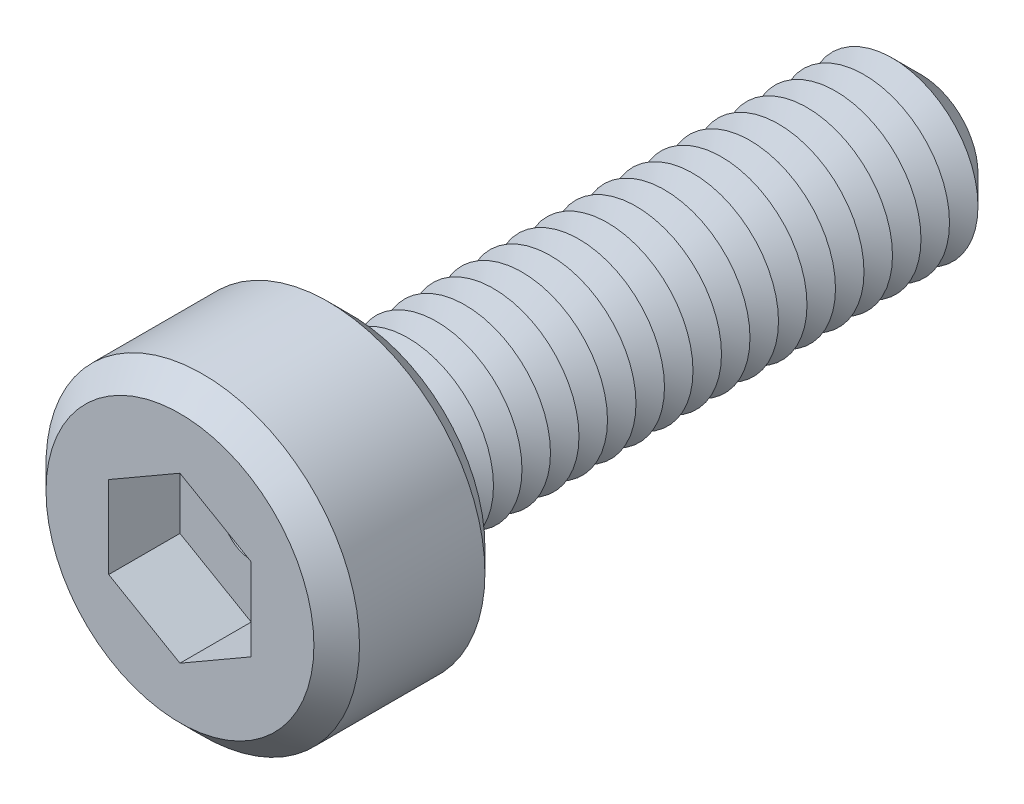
ISO-10303-21;
HEADER;
FILE_DESCRIPTION(('STEP AP214'),'2;1');
FILE_NAME('part.step','',(''),(''),'','','');
FILE_SCHEMA(('AUTOMOTIVE_DESIGN { 1 0 10303 214 1 1 1 1 }'));
ENDSEC;
DATA;
#1=APPLICATION_CONTEXT('core data for automotive mechanical design processes');
#2=APPLICATION_PROTOCOL_DEFINITION('international standard','automotive_design',2000,#1);
#3=PRODUCT_CONTEXT('',#1,'mechanical');
#4=PRODUCT('Part','Part','',(#3));
#5=PRODUCT_RELATED_PRODUCT_CATEGORY('part','',(#4));
#6=PRODUCT_DEFINITION_FORMATION('','',#4);
#7=PRODUCT_DEFINITION_CONTEXT('part definition',#1,'design');
#8=PRODUCT_DEFINITION('design','',#6,#7);
#9=PRODUCT_DEFINITION_SHAPE('','',#8);
#10=(LENGTH_UNIT() NAMED_UNIT(*) SI_UNIT(.MILLI.,.METRE.));
#11=(NAMED_UNIT(*) PLANE_ANGLE_UNIT() SI_UNIT($,.RADIAN.));
#12=(NAMED_UNIT(*) SI_UNIT($,.STERADIAN.) SOLID_ANGLE_UNIT());
#13=UNCERTAINTY_MEASURE_WITH_UNIT(LENGTH_MEASURE(1.E-05),#10,'distance_accuracy_value','');
#14=(GEOMETRIC_REPRESENTATION_CONTEXT(3) GLOBAL_UNCERTAINTY_ASSIGNED_CONTEXT((#13)) GLOBAL_UNIT_ASSIGNED_CONTEXT((#10,
#11,#12)) REPRESENTATION_CONTEXT('',''));
#15=CARTESIAN_POINT('',(0.,0.,0.));
#16=DIRECTION('',(0.,0.,1.));
#17=DIRECTION('',(1.,0.,0.));
#18=AXIS2_PLACEMENT_3D('',#15,#16,#17);
#19=CARTESIAN_POINT('',(0.,0.,3.));
#20=DIRECTION('',(0.,0.,-1.));
#21=DIRECTION('',(-1.,0.,0.));
#22=AXIS2_PLACEMENT_3D('',#19,#20,#21);
#23=CYLINDRICAL_SURFACE('',#22,2.75);
#24=CARTESIAN_POINT('',(0.,0.,0.4));
#25=DIRECTION('',(0.,0.,1.));
#26=DIRECTION('',(1.,0.,0.));
#27=AXIS2_PLACEMENT_3D('',#24,#25,#26);
#28=CIRCLE('',#27,2.75);
#29=CARTESIAN_POINT('',(2.75,0.,0.4));
#30=VERTEX_POINT('',#29);
#31=EDGE_CURVE('E328',#30,#30,#28,.T.);
#32=ORIENTED_EDGE('',*,*,#31,.T.);
#33=EDGE_LOOP('',(#32));
#34=FACE_BOUND('',#33,.T.);
#35=CARTESIAN_POINT('',(0.,0.,2.6));
#36=DIRECTION('',(0.,0.,1.));
#37=DIRECTION('',(1.,0.,0.));
#38=AXIS2_PLACEMENT_3D('',#35,#36,#37);
#39=CIRCLE('',#38,2.75);
#40=CARTESIAN_POINT('',(2.75,0.,2.6));
#41=VERTEX_POINT('',#40);
#42=EDGE_CURVE('E325',#41,#41,#39,.F.);
#43=ORIENTED_EDGE('',*,*,#42,.T.);
#44=EDGE_LOOP('',(#43));
#45=FACE_BOUND('',#44,.T.);
#46=ADVANCED_FACE('F39',(#34,#45),#23,.T.);
#47=CARTESIAN_POINT('',(0.,0.,3.));
#48=DIRECTION('',(0.,0.,1.));
#49=DIRECTION('',(1.,0.,0.));
#50=AXIS2_PLACEMENT_3D('',#47,#48,#49);
#51=PLANE('',#50);
#52=CARTESIAN_POINT('',(0.,0.,3.));
#53=DIRECTION('',(0.,0.,1.));
#54=DIRECTION('',(1.,0.,0.));
#55=AXIS2_PLACEMENT_3D('',#52,#53,#54);
#56=CIRCLE('',#55,2.35);
#57=CARTESIAN_POINT('',(2.35,0.,3.));
#58=VERTEX_POINT('',#57);
#59=EDGE_CURVE('E11',#58,#58,#56,.T.);
#60=ORIENTED_EDGE('',*,*,#59,.T.);
#61=EDGE_LOOP('',(#60));
#62=FACE_BOUND('',#61,.T.);
#63=DIRECTION('',(-0.866025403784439,0.5,0.));
#64=VECTOR('',#63,1.);
#65=CARTESIAN_POINT('',(1.25,0.721687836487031,3.));
#66=LINE('',#65,#64);
#67=CARTESIAN_POINT('',(1.25,0.721687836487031,3.));
#68=VERTEX_POINT('',#67);
#69=CARTESIAN_POINT('',(0.,1.44337567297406,3.));
#70=VERTEX_POINT('',#69);
#71=EDGE_CURVE('E55',#68,#70,#66,.T.);
#72=ORIENTED_EDGE('',*,*,#71,.F.);
#73=DIRECTION('',(0.,1.,0.));
#74=VECTOR('',#73,1.);
#75=CARTESIAN_POINT('',(1.25,-0.721687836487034,3.));
#76=LINE('',#75,#74);
#77=CARTESIAN_POINT('',(1.25,-0.721687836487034,3.));
#78=VERTEX_POINT('',#77);
#79=EDGE_CURVE('E151',#78,#68,#76,.T.);
#80=ORIENTED_EDGE('',*,*,#79,.F.);
#81=DIRECTION('',(0.866025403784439,0.5,0.));
#82=VECTOR('',#81,1.);
#83=CARTESIAN_POINT('',(0.,-1.44337567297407,3.));
#84=LINE('',#83,#82);
#85=CARTESIAN_POINT('',(0.,-1.44337567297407,3.));
#86=VERTEX_POINT('',#85);
#87=EDGE_CURVE('E148',#86,#78,#84,.T.);
#88=ORIENTED_EDGE('',*,*,#87,.F.);
#89=DIRECTION('',(0.866025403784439,-0.5,0.));
#90=VECTOR('',#89,1.);
#91=CARTESIAN_POINT('',(-1.25,-0.721687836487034,3.));
#92=LINE('',#91,#90);
#93=CARTESIAN_POINT('',(-1.25,-0.721687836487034,3.));
#94=VERTEX_POINT('',#93);
#95=EDGE_CURVE('E103',#94,#86,#92,.T.);
#96=ORIENTED_EDGE('',*,*,#95,.F.);
#97=DIRECTION('',(0.,-1.,0.));
#98=VECTOR('',#97,1.);
#99=CARTESIAN_POINT('',(-1.25,0.721687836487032,3.));
#100=LINE('',#99,#98);
#101=CARTESIAN_POINT('',(-1.25,0.721687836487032,3.));
#102=VERTEX_POINT('',#101);
#103=EDGE_CURVE('E142',#102,#94,#100,.T.);
#104=ORIENTED_EDGE('',*,*,#103,.F.);
#105=DIRECTION('',(-0.866025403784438,-0.5,0.));
#106=VECTOR('',#105,1.);
#107=CARTESIAN_POINT('',(0.,1.44337567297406,3.));
#108=LINE('',#107,#106);
#109=EDGE_CURVE('E137',#70,#102,#108,.T.);
#110=ORIENTED_EDGE('',*,*,#109,.F.);
#111=EDGE_LOOP('',(#72,#80,#88,#96,#104,#110));
#112=FACE_BOUND('',#111,.T.);
#113=ADVANCED_FACE('F346',(#62,#112),#51,.T.);
#114=CARTESIAN_POINT('',(0.,0.,0.));
#115=DIRECTION('',(0.,0.,1.));
#116=DIRECTION('',(1.,0.,0.));
#117=AXIS2_PLACEMENT_3D('',#114,#115,#116);
#118=PLANE('',#117);
#119=CARTESIAN_POINT('',(0.,0.,0.));
#120=DIRECTION('',(0.,0.,1.));
#121=DIRECTION('',(1.,0.,0.));
#122=AXIS2_PLACEMENT_3D('',#119,#120,#121);
#123=CIRCLE('',#122,2.35);
#124=CARTESIAN_POINT('',(2.35,0.,0.));
#125=VERTEX_POINT('',#124);
#126=EDGE_CURVE('E48',#125,#125,#123,.F.);
#127=ORIENTED_EDGE('',*,*,#126,.T.);
#128=EDGE_LOOP('',(#127));
#129=FACE_BOUND('',#128,.T.);
#130=CARTESIAN_POINT('',(0.,0.,0.));
#131=DIRECTION('',(0.,0.,1.));
#132=DIRECTION('',(1.,0.,0.));
#133=AXIS2_PLACEMENT_3D('',#130,#131,#132);
#134=CIRCLE('',#133,1.5);
#135=CARTESIAN_POINT('',(1.5,0.,0.));
#136=VERTEX_POINT('',#135);
#137=EDGE_CURVE('E317',#136,#136,#134,.T.);
#138=ORIENTED_EDGE('',*,*,#137,.T.);
#139=EDGE_LOOP('',(#138));
#140=FACE_BOUND('',#139,.T.);
#141=ADVANCED_FACE('F335',(#129,#140),#118,.F.);
#142=CARTESIAN_POINT('',(0.,0.,0.));
#143=DIRECTION('',(0.,0.,1.));
#144=DIRECTION('',(1.,0.,0.));
#145=AXIS2_PLACEMENT_3D('',#142,#143,#144);
#146=CONICAL_SURFACE('',#145,1.5,1.0471975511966);
#147=CARTESIAN_POINT('',(0.,0.,-0.250000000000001));
#148=DIRECTION('',(0.,0.,1.));
#149=DIRECTION('',(1.,0.,0.));
#150=AXIS2_PLACEMENT_3D('',#147,#148,#149);
#151=CIRCLE('',#150,1.06698729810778);
#152=CARTESIAN_POINT('',(1.06698729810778,0.,-0.250000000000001));
#153=VERTEX_POINT('',#152);
#154=EDGE_CURVE('E313',#153,#153,#151,.T.);
#155=ORIENTED_EDGE('',*,*,#154,.T.);
#156=EDGE_LOOP('',(#155));
#157=FACE_BOUND('',#156,.T.);
#158=ORIENTED_EDGE('',*,*,#137,.F.);
#159=EDGE_LOOP('',(#158));
#160=FACE_BOUND('',#159,.T.);
#161=ADVANCED_FACE('F548',(#157,#160),#146,.T.);
#162=CARTESIAN_POINT('',(0.,0.,-0.250000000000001));
#163=DIRECTION('',(0.,0.,-1.));
#164=DIRECTION('',(-1.,0.,0.));
#165=AXIS2_PLACEMENT_3D('',#162,#163,#164);
#166=CONICAL_SURFACE('',#165,1.06698729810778,1.0471975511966);
#167=CARTESIAN_POINT('',(0.,0.,-0.5));
#168=DIRECTION('',(0.,0.,1.));
#169=DIRECTION('',(1.,0.,0.));
#170=AXIS2_PLACEMENT_3D('',#167,#168,#169);
#171=CIRCLE('',#170,1.5);
#172=CARTESIAN_POINT('',(1.5,0.,-0.5));
#173=VERTEX_POINT('',#172);
#174=EDGE_CURVE('E309',#173,#173,#171,.T.);
#175=ORIENTED_EDGE('',*,*,#174,.T.);
#176=EDGE_LOOP('',(#175));
#177=FACE_BOUND('',#176,.T.);
#178=ORIENTED_EDGE('',*,*,#154,.F.);
#179=EDGE_LOOP('',(#178));
#180=FACE_BOUND('',#179,.T.);
#181=ADVANCED_FACE('F544',(#177,#180),#166,.T.);
#182=CARTESIAN_POINT('',(0.,0.,-0.5));
#183=DIRECTION('',(0.,0.,1.));
#184=DIRECTION('',(1.,0.,0.));
#185=AXIS2_PLACEMENT_3D('',#182,#183,#184);
#186=CONICAL_SURFACE('',#185,1.5,1.0471975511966);
#187=CARTESIAN_POINT('',(0.,0.,-0.750000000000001));
#188=DIRECTION('',(0.,0.,1.));
#189=DIRECTION('',(1.,0.,0.));
#190=AXIS2_PLACEMENT_3D('',#187,#188,#189);
#191=CIRCLE('',#190,1.06698729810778);
#192=CARTESIAN_POINT('',(1.06698729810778,0.,-0.750000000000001));
#193=VERTEX_POINT('',#192);
#194=EDGE_CURVE('E305',#193,#193,#191,.T.);
#195=ORIENTED_EDGE('',*,*,#194,.T.);
#196=EDGE_LOOP('',(#195));
#197=FACE_BOUND('',#196,.T.);
#198=ORIENTED_EDGE('',*,*,#174,.F.);
#199=EDGE_LOOP('',(#198));
#200=FACE_BOUND('',#199,.T.);
#201=ADVANCED_FACE('F540',(#197,#200),#186,.T.);
#202=CARTESIAN_POINT('',(0.,0.,-0.750000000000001));
#203=DIRECTION('',(0.,0.,-1.));
#204=DIRECTION('',(-1.,0.,0.));
#205=AXIS2_PLACEMENT_3D('',#202,#203,#204);
#206=CONICAL_SURFACE('',#205,1.06698729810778,1.0471975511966);
#207=CARTESIAN_POINT('',(0.,0.,-1.));
#208=DIRECTION('',(0.,0.,1.));
#209=DIRECTION('',(1.,0.,0.));
#210=AXIS2_PLACEMENT_3D('',#207,#208,#209);
#211=CIRCLE('',#210,1.5);
#212=CARTESIAN_POINT('',(1.5,0.,-1.));
#213=VERTEX_POINT('',#212);
#214=EDGE_CURVE('E301',#213,#213,#211,.T.);
#215=ORIENTED_EDGE('',*,*,#214,.T.);
#216=EDGE_LOOP('',(#215));
#217=FACE_BOUND('',#216,.T.);
#218=ORIENTED_EDGE('',*,*,#194,.F.);
#219=EDGE_LOOP('',(#218));
#220=FACE_BOUND('',#219,.T.);
#221=ADVANCED_FACE('F536',(#217,#220),#206,.T.);
#222=CARTESIAN_POINT('',(0.,0.,-1.));
#223=DIRECTION('',(0.,0.,1.));
#224=DIRECTION('',(1.,0.,0.));
#225=AXIS2_PLACEMENT_3D('',#222,#223,#224);
#226=CONICAL_SURFACE('',#225,1.5,1.0471975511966);
#227=CARTESIAN_POINT('',(0.,0.,-1.25));
#228=DIRECTION('',(0.,0.,1.));
#229=DIRECTION('',(1.,0.,0.));
#230=AXIS2_PLACEMENT_3D('',#227,#228,#229);
#231=CIRCLE('',#230,1.06698729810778);
#232=CARTESIAN_POINT('',(1.06698729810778,0.,-1.25));
#233=VERTEX_POINT('',#232);
#234=EDGE_CURVE('E297',#233,#233,#231,.T.);
#235=ORIENTED_EDGE('',*,*,#234,.T.);
#236=EDGE_LOOP('',(#235));
#237=FACE_BOUND('',#236,.T.);
#238=ORIENTED_EDGE('',*,*,#214,.F.);
#239=EDGE_LOOP('',(#238));
#240=FACE_BOUND('',#239,.T.);
#241=ADVANCED_FACE('F532',(#237,#240),#226,.T.);
#242=CARTESIAN_POINT('',(0.,0.,-1.25));
#243=DIRECTION('',(0.,0.,-1.));
#244=DIRECTION('',(-1.,0.,0.));
#245=AXIS2_PLACEMENT_3D('',#242,#243,#244);
#246=CONICAL_SURFACE('',#245,1.06698729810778,1.0471975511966);
#247=CARTESIAN_POINT('',(0.,0.,-1.5));
#248=DIRECTION('',(0.,0.,1.));
#249=DIRECTION('',(1.,0.,0.));
#250=AXIS2_PLACEMENT_3D('',#247,#248,#249);
#251=CIRCLE('',#250,1.5);
#252=CARTESIAN_POINT('',(1.5,0.,-1.5));
#253=VERTEX_POINT('',#252);
#254=EDGE_CURVE('E293',#253,#253,#251,.T.);
#255=ORIENTED_EDGE('',*,*,#254,.T.);
#256=EDGE_LOOP('',(#255));
#257=FACE_BOUND('',#256,.T.);
#258=ORIENTED_EDGE('',*,*,#234,.F.);
#259=EDGE_LOOP('',(#258));
#260=FACE_BOUND('',#259,.T.);
#261=ADVANCED_FACE('F528',(#257,#260),#246,.T.);
#262=CARTESIAN_POINT('',(0.,0.,-1.5));
#263=DIRECTION('',(0.,0.,1.));
#264=DIRECTION('',(1.,0.,0.));
#265=AXIS2_PLACEMENT_3D('',#262,#263,#264);
#266=CONICAL_SURFACE('',#265,1.5,1.0471975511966);
#267=CARTESIAN_POINT('',(0.,0.,-1.75));
#268=DIRECTION('',(0.,0.,1.));
#269=DIRECTION('',(1.,0.,0.));
#270=AXIS2_PLACEMENT_3D('',#267,#268,#269);
#271=CIRCLE('',#270,1.06698729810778);
#272=CARTESIAN_POINT('',(1.06698729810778,0.,-1.75));
#273=VERTEX_POINT('',#272);
#274=EDGE_CURVE('E289',#273,#273,#271,.T.);
#275=ORIENTED_EDGE('',*,*,#274,.T.);
#276=EDGE_LOOP('',(#275));
#277=FACE_BOUND('',#276,.T.);
#278=ORIENTED_EDGE('',*,*,#254,.F.);
#279=EDGE_LOOP('',(#278));
#280=FACE_BOUND('',#279,.T.);
#281=ADVANCED_FACE('F524',(#277,#280),#266,.T.);
#282=CARTESIAN_POINT('',(0.,0.,-1.75));
#283=DIRECTION('',(0.,0.,-1.));
#284=DIRECTION('',(-1.,0.,0.));
#285=AXIS2_PLACEMENT_3D('',#282,#283,#284);
#286=CONICAL_SURFACE('',#285,1.06698729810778,1.0471975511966);
#287=CARTESIAN_POINT('',(0.,0.,-2.));
#288=DIRECTION('',(0.,0.,1.));
#289=DIRECTION('',(1.,0.,0.));
#290=AXIS2_PLACEMENT_3D('',#287,#288,#289);
#291=CIRCLE('',#290,1.5);
#292=CARTESIAN_POINT('',(1.5,0.,-2.));
#293=VERTEX_POINT('',#292);
#294=EDGE_CURVE('E285',#293,#293,#291,.T.);
#295=ORIENTED_EDGE('',*,*,#294,.T.);
#296=EDGE_LOOP('',(#295));
#297=FACE_BOUND('',#296,.T.);
#298=ORIENTED_EDGE('',*,*,#274,.F.);
#299=EDGE_LOOP('',(#298));
#300=FACE_BOUND('',#299,.T.);
#301=ADVANCED_FACE('F520',(#297,#300),#286,.T.);
#302=CARTESIAN_POINT('',(0.,0.,-2.));
#303=DIRECTION('',(0.,0.,1.));
#304=DIRECTION('',(1.,0.,0.));
#305=AXIS2_PLACEMENT_3D('',#302,#303,#304);
#306=CONICAL_SURFACE('',#305,1.5,1.0471975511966);
#307=CARTESIAN_POINT('',(0.,0.,-2.25));
#308=DIRECTION('',(0.,0.,1.));
#309=DIRECTION('',(1.,0.,0.));
#310=AXIS2_PLACEMENT_3D('',#307,#308,#309);
#311=CIRCLE('',#310,1.06698729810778);
#312=CARTESIAN_POINT('',(1.06698729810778,0.,-2.25));
#313=VERTEX_POINT('',#312);
#314=EDGE_CURVE('E281',#313,#313,#311,.T.);
#315=ORIENTED_EDGE('',*,*,#314,.T.);
#316=EDGE_LOOP('',(#315));
#317=FACE_BOUND('',#316,.T.);
#318=ORIENTED_EDGE('',*,*,#294,.F.);
#319=EDGE_LOOP('',(#318));
#320=FACE_BOUND('',#319,.T.);
#321=ADVANCED_FACE('F516',(#317,#320),#306,.T.);
#322=CARTESIAN_POINT('',(0.,0.,-2.25));
#323=DIRECTION('',(0.,0.,-1.));
#324=DIRECTION('',(-1.,0.,0.));
#325=AXIS2_PLACEMENT_3D('',#322,#323,#324);
#326=CONICAL_SURFACE('',#325,1.06698729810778,1.0471975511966);
#327=CARTESIAN_POINT('',(0.,0.,-2.5));
#328=DIRECTION('',(0.,0.,1.));
#329=DIRECTION('',(1.,0.,0.));
#330=AXIS2_PLACEMENT_3D('',#327,#328,#329);
#331=CIRCLE('',#330,1.5);
#332=CARTESIAN_POINT('',(1.5,0.,-2.5));
#333=VERTEX_POINT('',#332);
#334=EDGE_CURVE('E277',#333,#333,#331,.T.);
#335=ORIENTED_EDGE('',*,*,#334,.T.);
#336=EDGE_LOOP('',(#335));
#337=FACE_BOUND('',#336,.T.);
#338=ORIENTED_EDGE('',*,*,#314,.F.);
#339=EDGE_LOOP('',(#338));
#340=FACE_BOUND('',#339,.T.);
#341=ADVANCED_FACE('F512',(#337,#340),#326,.T.);
#342=CARTESIAN_POINT('',(0.,0.,-2.5));
#343=DIRECTION('',(0.,0.,1.));
#344=DIRECTION('',(1.,0.,0.));
#345=AXIS2_PLACEMENT_3D('',#342,#343,#344);
#346=CONICAL_SURFACE('',#345,1.5,1.0471975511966);
#347=CARTESIAN_POINT('',(0.,0.,-2.75));
#348=DIRECTION('',(0.,0.,1.));
#349=DIRECTION('',(1.,0.,0.));
#350=AXIS2_PLACEMENT_3D('',#347,#348,#349);
#351=CIRCLE('',#350,1.06698729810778);
#352=CARTESIAN_POINT('',(1.06698729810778,0.,-2.75));
#353=VERTEX_POINT('',#352);
#354=EDGE_CURVE('E273',#353,#353,#351,.T.);
#355=ORIENTED_EDGE('',*,*,#354,.T.);
#356=EDGE_LOOP('',(#355));
#357=FACE_BOUND('',#356,.T.);
#358=ORIENTED_EDGE('',*,*,#334,.F.);
#359=EDGE_LOOP('',(#358));
#360=FACE_BOUND('',#359,.T.);
#361=ADVANCED_FACE('F508',(#357,#360),#346,.T.);
#362=CARTESIAN_POINT('',(0.,0.,-2.75));
#363=DIRECTION('',(0.,0.,-1.));
#364=DIRECTION('',(-1.,0.,0.));
#365=AXIS2_PLACEMENT_3D('',#362,#363,#364);
#366=CONICAL_SURFACE('',#365,1.06698729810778,1.0471975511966);
#367=CARTESIAN_POINT('',(0.,0.,-3.));
#368=DIRECTION('',(0.,0.,1.));
#369=DIRECTION('',(1.,0.,0.));
#370=AXIS2_PLACEMENT_3D('',#367,#368,#369);
#371=CIRCLE('',#370,1.5);
#372=CARTESIAN_POINT('',(1.5,0.,-3.));
#373=VERTEX_POINT('',#372);
#374=EDGE_CURVE('E269',#373,#373,#371,.T.);
#375=ORIENTED_EDGE('',*,*,#374,.T.);
#376=EDGE_LOOP('',(#375));
#377=FACE_BOUND('',#376,.T.);
#378=ORIENTED_EDGE('',*,*,#354,.F.);
#379=EDGE_LOOP('',(#378));
#380=FACE_BOUND('',#379,.T.);
#381=ADVANCED_FACE('F504',(#377,#380),#366,.T.);
#382=CARTESIAN_POINT('',(0.,0.,-3.));
#383=DIRECTION('',(0.,0.,1.));
#384=DIRECTION('',(1.,0.,0.));
#385=AXIS2_PLACEMENT_3D('',#382,#383,#384);
#386=CONICAL_SURFACE('',#385,1.5,1.0471975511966);
#387=CARTESIAN_POINT('',(0.,0.,-3.25));
#388=DIRECTION('',(0.,0.,1.));
#389=DIRECTION('',(1.,0.,0.));
#390=AXIS2_PLACEMENT_3D('',#387,#388,#389);
#391=CIRCLE('',#390,1.06698729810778);
#392=CARTESIAN_POINT('',(1.06698729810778,0.,-3.25));
#393=VERTEX_POINT('',#392);
#394=EDGE_CURVE('E265',#393,#393,#391,.T.);
#395=ORIENTED_EDGE('',*,*,#394,.T.);
#396=EDGE_LOOP('',(#395));
#397=FACE_BOUND('',#396,.T.);
#398=ORIENTED_EDGE('',*,*,#374,.F.);
#399=EDGE_LOOP('',(#398));
#400=FACE_BOUND('',#399,.T.);
#401=ADVANCED_FACE('F500',(#397,#400),#386,.T.);
#402=CARTESIAN_POINT('',(0.,0.,-3.25));
#403=DIRECTION('',(0.,0.,-1.));
#404=DIRECTION('',(-1.,0.,0.));
#405=AXIS2_PLACEMENT_3D('',#402,#403,#404);
#406=CONICAL_SURFACE('',#405,1.06698729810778,1.0471975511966);
#407=CARTESIAN_POINT('',(0.,0.,-3.5));
#408=DIRECTION('',(0.,0.,1.));
#409=DIRECTION('',(1.,0.,0.));
#410=AXIS2_PLACEMENT_3D('',#407,#408,#409);
#411=CIRCLE('',#410,1.5);
#412=CARTESIAN_POINT('',(1.5,0.,-3.5));
#413=VERTEX_POINT('',#412);
#414=EDGE_CURVE('E261',#413,#413,#411,.T.);
#415=ORIENTED_EDGE('',*,*,#414,.T.);
#416=EDGE_LOOP('',(#415));
#417=FACE_BOUND('',#416,.T.);
#418=ORIENTED_EDGE('',*,*,#394,.F.);
#419=EDGE_LOOP('',(#418));
#420=FACE_BOUND('',#419,.T.);
#421=ADVANCED_FACE('F496',(#417,#420),#406,.T.);
#422=CARTESIAN_POINT('',(0.,0.,-3.5));
#423=DIRECTION('',(0.,0.,1.));
#424=DIRECTION('',(1.,0.,0.));
#425=AXIS2_PLACEMENT_3D('',#422,#423,#424);
#426=CONICAL_SURFACE('',#425,1.5,1.0471975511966);
#427=CARTESIAN_POINT('',(0.,0.,-3.75));
#428=DIRECTION('',(0.,0.,1.));
#429=DIRECTION('',(1.,0.,0.));
#430=AXIS2_PLACEMENT_3D('',#427,#428,#429);
#431=CIRCLE('',#430,1.06698729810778);
#432=CARTESIAN_POINT('',(1.06698729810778,0.,-3.75));
#433=VERTEX_POINT('',#432);
#434=EDGE_CURVE('E257',#433,#433,#431,.T.);
#435=ORIENTED_EDGE('',*,*,#434,.T.);
#436=EDGE_LOOP('',(#435));
#437=FACE_BOUND('',#436,.T.);
#438=ORIENTED_EDGE('',*,*,#414,.F.);
#439=EDGE_LOOP('',(#438));
#440=FACE_BOUND('',#439,.T.);
#441=ADVANCED_FACE('F492',(#437,#440),#426,.T.);
#442=CARTESIAN_POINT('',(0.,0.,-3.75));
#443=DIRECTION('',(0.,0.,-1.));
#444=DIRECTION('',(-1.,0.,0.));
#445=AXIS2_PLACEMENT_3D('',#442,#443,#444);
#446=CONICAL_SURFACE('',#445,1.06698729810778,1.0471975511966);
#447=CARTESIAN_POINT('',(0.,0.,-4.));
#448=DIRECTION('',(0.,0.,1.));
#449=DIRECTION('',(1.,0.,0.));
#450=AXIS2_PLACEMENT_3D('',#447,#448,#449);
#451=CIRCLE('',#450,1.5);
#452=CARTESIAN_POINT('',(1.5,0.,-4.));
#453=VERTEX_POINT('',#452);
#454=EDGE_CURVE('E253',#453,#453,#451,.T.);
#455=ORIENTED_EDGE('',*,*,#454,.T.);
#456=EDGE_LOOP('',(#455));
#457=FACE_BOUND('',#456,.T.);
#458=ORIENTED_EDGE('',*,*,#434,.F.);
#459=EDGE_LOOP('',(#458));
#460=FACE_BOUND('',#459,.T.);
#461=ADVANCED_FACE('F488',(#457,#460),#446,.T.);
#462=CARTESIAN_POINT('',(0.,0.,-4.));
#463=DIRECTION('',(0.,0.,1.));
#464=DIRECTION('',(1.,0.,0.));
#465=AXIS2_PLACEMENT_3D('',#462,#463,#464);
#466=CONICAL_SURFACE('',#465,1.5,1.0471975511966);
#467=CARTESIAN_POINT('',(0.,0.,-4.25));
#468=DIRECTION('',(0.,0.,1.));
#469=DIRECTION('',(1.,0.,0.));
#470=AXIS2_PLACEMENT_3D('',#467,#468,#469);
#471=CIRCLE('',#470,1.06698729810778);
#472=CARTESIAN_POINT('',(1.06698729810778,0.,-4.25));
#473=VERTEX_POINT('',#472);
#474=EDGE_CURVE('E249',#473,#473,#471,.T.);
#475=ORIENTED_EDGE('',*,*,#474,.T.);
#476=EDGE_LOOP('',(#475));
#477=FACE_BOUND('',#476,.T.);
#478=ORIENTED_EDGE('',*,*,#454,.F.);
#479=EDGE_LOOP('',(#478));
#480=FACE_BOUND('',#479,.T.);
#481=ADVANCED_FACE('F484',(#477,#480),#466,.T.);
#482=CARTESIAN_POINT('',(0.,0.,-4.25));
#483=DIRECTION('',(0.,0.,-1.));
#484=DIRECTION('',(-1.,0.,0.));
#485=AXIS2_PLACEMENT_3D('',#482,#483,#484);
#486=CONICAL_SURFACE('',#485,1.06698729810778,1.0471975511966);
#487=CARTESIAN_POINT('',(0.,0.,-4.5));
#488=DIRECTION('',(0.,0.,1.));
#489=DIRECTION('',(1.,0.,0.));
#490=AXIS2_PLACEMENT_3D('',#487,#488,#489);
#491=CIRCLE('',#490,1.5);
#492=CARTESIAN_POINT('',(1.5,0.,-4.5));
#493=VERTEX_POINT('',#492);
#494=EDGE_CURVE('E245',#493,#493,#491,.T.);
#495=ORIENTED_EDGE('',*,*,#494,.T.);
#496=EDGE_LOOP('',(#495));
#497=FACE_BOUND('',#496,.T.);
#498=ORIENTED_EDGE('',*,*,#474,.F.);
#499=EDGE_LOOP('',(#498));
#500=FACE_BOUND('',#499,.T.);
#501=ADVANCED_FACE('F480',(#497,#500),#486,.T.);
#502=CARTESIAN_POINT('',(0.,0.,-4.5));
#503=DIRECTION('',(0.,0.,1.));
#504=DIRECTION('',(1.,0.,0.));
#505=AXIS2_PLACEMENT_3D('',#502,#503,#504);
#506=CONICAL_SURFACE('',#505,1.5,1.0471975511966);
#507=CARTESIAN_POINT('',(0.,0.,-4.75));
#508=DIRECTION('',(0.,0.,1.));
#509=DIRECTION('',(1.,0.,0.));
#510=AXIS2_PLACEMENT_3D('',#507,#508,#509);
#511=CIRCLE('',#510,1.06698729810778);
#512=CARTESIAN_POINT('',(1.06698729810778,0.,-4.75));
#513=VERTEX_POINT('',#512);
#514=EDGE_CURVE('E241',#513,#513,#511,.T.);
#515=ORIENTED_EDGE('',*,*,#514,.T.);
#516=EDGE_LOOP('',(#515));
#517=FACE_BOUND('',#516,.T.);
#518=ORIENTED_EDGE('',*,*,#494,.F.);
#519=EDGE_LOOP('',(#518));
#520=FACE_BOUND('',#519,.T.);
#521=ADVANCED_FACE('F476',(#517,#520),#506,.T.);
#522=CARTESIAN_POINT('',(0.,0.,-4.75));
#523=DIRECTION('',(0.,0.,-1.));
#524=DIRECTION('',(-1.,0.,0.));
#525=AXIS2_PLACEMENT_3D('',#522,#523,#524);
#526=CONICAL_SURFACE('',#525,1.06698729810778,1.0471975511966);
#527=CARTESIAN_POINT('',(0.,0.,-5.));
#528=DIRECTION('',(0.,0.,1.));
#529=DIRECTION('',(1.,0.,0.));
#530=AXIS2_PLACEMENT_3D('',#527,#528,#529);
#531=CIRCLE('',#530,1.5);
#532=CARTESIAN_POINT('',(1.5,0.,-5.));
#533=VERTEX_POINT('',#532);
#534=EDGE_CURVE('E238',#533,#533,#531,.T.);
#535=ORIENTED_EDGE('',*,*,#534,.T.);
#536=EDGE_LOOP('',(#535));
#537=FACE_BOUND('',#536,.T.);
#538=ORIENTED_EDGE('',*,*,#514,.F.);
#539=EDGE_LOOP('',(#538));
#540=FACE_BOUND('',#539,.T.);
#541=ADVANCED_FACE('F472',(#537,#540),#526,.T.);
#542=CARTESIAN_POINT('',(0.,0.,-5.));
#543=DIRECTION('',(0.,0.,1.));
#544=DIRECTION('',(1.,0.,0.));
#545=AXIS2_PLACEMENT_3D('',#542,#543,#544);
#546=CONICAL_SURFACE('',#545,1.5,1.0471975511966);
#547=CARTESIAN_POINT('',(0.,0.,-5.25));
#548=DIRECTION('',(0.,0.,1.));
#549=DIRECTION('',(1.,0.,0.));
#550=AXIS2_PLACEMENT_3D('',#547,#548,#549);
#551=CIRCLE('',#550,1.06698729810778);
#552=CARTESIAN_POINT('',(1.06698729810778,0.,-5.25));
#553=VERTEX_POINT('',#552);
#554=EDGE_CURVE('E234',#553,#553,#551,.T.);
#555=ORIENTED_EDGE('',*,*,#554,.T.);
#556=EDGE_LOOP('',(#555));
#557=FACE_BOUND('',#556,.T.);
#558=ORIENTED_EDGE('',*,*,#534,.F.);
#559=EDGE_LOOP('',(#558));
#560=FACE_BOUND('',#559,.T.);
#561=ADVANCED_FACE('F468',(#557,#560),#546,.T.);
#562=CARTESIAN_POINT('',(0.,0.,-5.25));
#563=DIRECTION('',(0.,0.,-1.));
#564=DIRECTION('',(-1.,0.,0.));
#565=AXIS2_PLACEMENT_3D('',#562,#563,#564);
#566=CONICAL_SURFACE('',#565,1.06698729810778,1.0471975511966);
#567=CARTESIAN_POINT('',(0.,0.,-5.5));
#568=DIRECTION('',(0.,0.,1.));
#569=DIRECTION('',(1.,0.,0.));
#570=AXIS2_PLACEMENT_3D('',#567,#568,#569);
#571=CIRCLE('',#570,1.5);
#572=CARTESIAN_POINT('',(1.5,0.,-5.5));
#573=VERTEX_POINT('',#572);
#574=EDGE_CURVE('E230',#573,#573,#571,.T.);
#575=ORIENTED_EDGE('',*,*,#574,.T.);
#576=EDGE_LOOP('',(#575));
#577=FACE_BOUND('',#576,.T.);
#578=ORIENTED_EDGE('',*,*,#554,.F.);
#579=EDGE_LOOP('',(#578));
#580=FACE_BOUND('',#579,.T.);
#581=ADVANCED_FACE('F464',(#577,#580),#566,.T.);
#582=CARTESIAN_POINT('',(0.,0.,-5.5));
#583=DIRECTION('',(0.,0.,1.));
#584=DIRECTION('',(1.,0.,0.));
#585=AXIS2_PLACEMENT_3D('',#582,#583,#584);
#586=CONICAL_SURFACE('',#585,1.5,1.0471975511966);
#587=CARTESIAN_POINT('',(0.,0.,-5.75));
#588=DIRECTION('',(0.,0.,1.));
#589=DIRECTION('',(1.,0.,0.));
#590=AXIS2_PLACEMENT_3D('',#587,#588,#589);
#591=CIRCLE('',#590,1.06698729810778);
#592=CARTESIAN_POINT('',(1.06698729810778,0.,-5.75));
#593=VERTEX_POINT('',#592);
#594=EDGE_CURVE('E226',#593,#593,#591,.T.);
#595=ORIENTED_EDGE('',*,*,#594,.T.);
#596=EDGE_LOOP('',(#595));
#597=FACE_BOUND('',#596,.T.);
#598=ORIENTED_EDGE('',*,*,#574,.F.);
#599=EDGE_LOOP('',(#598));
#600=FACE_BOUND('',#599,.T.);
#601=ADVANCED_FACE('F460',(#597,#600),#586,.T.);
#602=CARTESIAN_POINT('',(0.,0.,-5.75));
#603=DIRECTION('',(0.,0.,-1.));
#604=DIRECTION('',(-1.,0.,0.));
#605=AXIS2_PLACEMENT_3D('',#602,#603,#604);
#606=CONICAL_SURFACE('',#605,1.06698729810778,1.0471975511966);
#607=CARTESIAN_POINT('',(0.,0.,-6.));
#608=DIRECTION('',(0.,0.,1.));
#609=DIRECTION('',(1.,0.,0.));
#610=AXIS2_PLACEMENT_3D('',#607,#608,#609);
#611=CIRCLE('',#610,1.5);
#612=CARTESIAN_POINT('',(1.5,0.,-6.));
#613=VERTEX_POINT('',#612);
#614=EDGE_CURVE('E222',#613,#613,#611,.T.);
#615=ORIENTED_EDGE('',*,*,#614,.T.);
#616=EDGE_LOOP('',(#615));
#617=FACE_BOUND('',#616,.T.);
#618=ORIENTED_EDGE('',*,*,#594,.F.);
#619=EDGE_LOOP('',(#618));
#620=FACE_BOUND('',#619,.T.);
#621=ADVANCED_FACE('F456',(#617,#620),#606,.T.);
#622=CARTESIAN_POINT('',(0.,0.,-6.));
#623=DIRECTION('',(0.,0.,1.));
#624=DIRECTION('',(1.,0.,0.));
#625=AXIS2_PLACEMENT_3D('',#622,#623,#624);
#626=CONICAL_SURFACE('',#625,1.5,1.0471975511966);
#627=CARTESIAN_POINT('',(0.,0.,-6.25));
#628=DIRECTION('',(0.,0.,1.));
#629=DIRECTION('',(1.,0.,0.));
#630=AXIS2_PLACEMENT_3D('',#627,#628,#629);
#631=CIRCLE('',#630,1.06698729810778);
#632=CARTESIAN_POINT('',(1.06698729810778,0.,-6.25));
#633=VERTEX_POINT('',#632);
#634=EDGE_CURVE('E218',#633,#633,#631,.T.);
#635=ORIENTED_EDGE('',*,*,#634,.T.);
#636=EDGE_LOOP('',(#635));
#637=FACE_BOUND('',#636,.T.);
#638=ORIENTED_EDGE('',*,*,#614,.F.);
#639=EDGE_LOOP('',(#638));
#640=FACE_BOUND('',#639,.T.);
#641=ADVANCED_FACE('F452',(#637,#640),#626,.T.);
#642=CARTESIAN_POINT('',(0.,0.,-6.25));
#643=DIRECTION('',(0.,0.,-1.));
#644=DIRECTION('',(-1.,0.,0.));
#645=AXIS2_PLACEMENT_3D('',#642,#643,#644);
#646=CONICAL_SURFACE('',#645,1.06698729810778,1.0471975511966);
#647=CARTESIAN_POINT('',(0.,0.,-6.5));
#648=DIRECTION('',(0.,0.,1.));
#649=DIRECTION('',(1.,0.,0.));
#650=AXIS2_PLACEMENT_3D('',#647,#648,#649);
#651=CIRCLE('',#650,1.5);
#652=CARTESIAN_POINT('',(1.5,0.,-6.5));
#653=VERTEX_POINT('',#652);
#654=EDGE_CURVE('E214',#653,#653,#651,.T.);
#655=ORIENTED_EDGE('',*,*,#654,.T.);
#656=EDGE_LOOP('',(#655));
#657=FACE_BOUND('',#656,.T.);
#658=ORIENTED_EDGE('',*,*,#634,.F.);
#659=EDGE_LOOP('',(#658));
#660=FACE_BOUND('',#659,.T.);
#661=ADVANCED_FACE('F448',(#657,#660),#646,.T.);
#662=CARTESIAN_POINT('',(0.,0.,-6.5));
#663=DIRECTION('',(0.,0.,1.));
#664=DIRECTION('',(1.,0.,0.));
#665=AXIS2_PLACEMENT_3D('',#662,#663,#664);
#666=CONICAL_SURFACE('',#665,1.5,1.0471975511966);
#667=CARTESIAN_POINT('',(0.,0.,-6.75));
#668=DIRECTION('',(0.,0.,1.));
#669=DIRECTION('',(1.,0.,0.));
#670=AXIS2_PLACEMENT_3D('',#667,#668,#669);
#671=CIRCLE('',#670,1.06698729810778);
#672=CARTESIAN_POINT('',(1.06698729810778,0.,-6.75));
#673=VERTEX_POINT('',#672);
#674=EDGE_CURVE('E210',#673,#673,#671,.T.);
#675=ORIENTED_EDGE('',*,*,#674,.T.);
#676=EDGE_LOOP('',(#675));
#677=FACE_BOUND('',#676,.T.);
#678=ORIENTED_EDGE('',*,*,#654,.F.);
#679=EDGE_LOOP('',(#678));
#680=FACE_BOUND('',#679,.T.);
#681=ADVANCED_FACE('F444',(#677,#680),#666,.T.);
#682=CARTESIAN_POINT('',(0.,0.,-6.75));
#683=DIRECTION('',(0.,0.,-1.));
#684=DIRECTION('',(-1.,0.,0.));
#685=AXIS2_PLACEMENT_3D('',#682,#683,#684);
#686=CONICAL_SURFACE('',#685,1.06698729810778,1.0471975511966);
#687=CARTESIAN_POINT('',(0.,0.,-7.));
#688=DIRECTION('',(0.,0.,1.));
#689=DIRECTION('',(1.,0.,0.));
#690=AXIS2_PLACEMENT_3D('',#687,#688,#689);
#691=CIRCLE('',#690,1.5);
#692=CARTESIAN_POINT('',(1.5,0.,-7.));
#693=VERTEX_POINT('',#692);
#694=EDGE_CURVE('E206',#693,#693,#691,.T.);
#695=ORIENTED_EDGE('',*,*,#694,.T.);
#696=EDGE_LOOP('',(#695));
#697=FACE_BOUND('',#696,.T.);
#698=ORIENTED_EDGE('',*,*,#674,.F.);
#699=EDGE_LOOP('',(#698));
#700=FACE_BOUND('',#699,.T.);
#701=ADVANCED_FACE('F440',(#697,#700),#686,.T.);
#702=CARTESIAN_POINT('',(0.,0.,-7.));
#703=DIRECTION('',(0.,0.,1.));
#704=DIRECTION('',(1.,0.,0.));
#705=AXIS2_PLACEMENT_3D('',#702,#703,#704);
#706=CONICAL_SURFACE('',#705,1.5,1.0471975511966);
#707=CARTESIAN_POINT('',(0.,0.,-7.25));
#708=DIRECTION('',(0.,0.,1.));
#709=DIRECTION('',(1.,0.,0.));
#710=AXIS2_PLACEMENT_3D('',#707,#708,#709);
#711=CIRCLE('',#710,1.06698729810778);
#712=CARTESIAN_POINT('',(1.06698729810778,0.,-7.25));
#713=VERTEX_POINT('',#712);
#714=EDGE_CURVE('E202',#713,#713,#711,.T.);
#715=ORIENTED_EDGE('',*,*,#714,.T.);
#716=EDGE_LOOP('',(#715));
#717=FACE_BOUND('',#716,.T.);
#718=ORIENTED_EDGE('',*,*,#694,.F.);
#719=EDGE_LOOP('',(#718));
#720=FACE_BOUND('',#719,.T.);
#721=ADVANCED_FACE('F436',(#717,#720),#706,.T.);
#722=CARTESIAN_POINT('',(0.,0.,-7.25));
#723=DIRECTION('',(0.,0.,-1.));
#724=DIRECTION('',(-1.,0.,0.));
#725=AXIS2_PLACEMENT_3D('',#722,#723,#724);
#726=CONICAL_SURFACE('',#725,1.06698729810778,1.0471975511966);
#727=CARTESIAN_POINT('',(0.,0.,-7.5));
#728=DIRECTION('',(0.,0.,1.));
#729=DIRECTION('',(1.,0.,0.));
#730=AXIS2_PLACEMENT_3D('',#727,#728,#729);
#731=CIRCLE('',#730,1.5);
#732=CARTESIAN_POINT('',(1.5,0.,-7.5));
#733=VERTEX_POINT('',#732);
#734=EDGE_CURVE('E198',#733,#733,#731,.T.);
#735=ORIENTED_EDGE('',*,*,#734,.T.);
#736=EDGE_LOOP('',(#735));
#737=FACE_BOUND('',#736,.T.);
#738=ORIENTED_EDGE('',*,*,#714,.F.);
#739=EDGE_LOOP('',(#738));
#740=FACE_BOUND('',#739,.T.);
#741=ADVANCED_FACE('F432',(#737,#740),#726,.T.);
#742=CARTESIAN_POINT('',(0.,0.,-7.5));
#743=DIRECTION('',(0.,0.,1.));
#744=DIRECTION('',(1.,0.,0.));
#745=AXIS2_PLACEMENT_3D('',#742,#743,#744);
#746=CONICAL_SURFACE('',#745,1.5,1.0471975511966);
#747=CARTESIAN_POINT('',(0.,0.,-7.75));
#748=DIRECTION('',(0.,0.,1.));
#749=DIRECTION('',(1.,0.,0.));
#750=AXIS2_PLACEMENT_3D('',#747,#748,#749);
#751=CIRCLE('',#750,1.06698729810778);
#752=CARTESIAN_POINT('',(1.06698729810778,0.,-7.75));
#753=VERTEX_POINT('',#752);
#754=EDGE_CURVE('E194',#753,#753,#751,.T.);
#755=ORIENTED_EDGE('',*,*,#754,.T.);
#756=EDGE_LOOP('',(#755));
#757=FACE_BOUND('',#756,.T.);
#758=ORIENTED_EDGE('',*,*,#734,.F.);
#759=EDGE_LOOP('',(#758));
#760=FACE_BOUND('',#759,.T.);
#761=ADVANCED_FACE('F428',(#757,#760),#746,.T.);
#762=CARTESIAN_POINT('',(0.,0.,-7.75));
#763=DIRECTION('',(0.,0.,-1.));
#764=DIRECTION('',(-1.,0.,0.));
#765=AXIS2_PLACEMENT_3D('',#762,#763,#764);
#766=CONICAL_SURFACE('',#765,1.06698729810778,1.0471975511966);
#767=CARTESIAN_POINT('',(0.,0.,-8.));
#768=DIRECTION('',(0.,0.,1.));
#769=DIRECTION('',(1.,0.,0.));
#770=AXIS2_PLACEMENT_3D('',#767,#768,#769);
#771=CIRCLE('',#770,1.5);
#772=CARTESIAN_POINT('',(1.5,0.,-8.));
#773=VERTEX_POINT('',#772);
#774=EDGE_CURVE('E190',#773,#773,#771,.T.);
#775=ORIENTED_EDGE('',*,*,#774,.T.);
#776=EDGE_LOOP('',(#775));
#777=FACE_BOUND('',#776,.T.);
#778=ORIENTED_EDGE('',*,*,#754,.F.);
#779=EDGE_LOOP('',(#778));
#780=FACE_BOUND('',#779,.T.);
#781=ADVANCED_FACE('F424',(#777,#780),#766,.T.);
#782=CARTESIAN_POINT('',(0.,0.,-8.));
#783=DIRECTION('',(0.,0.,1.));
#784=DIRECTION('',(1.,0.,0.));
#785=AXIS2_PLACEMENT_3D('',#782,#783,#784);
#786=CONICAL_SURFACE('',#785,1.5,1.0471975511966);
#787=CARTESIAN_POINT('',(0.,0.,-8.25));
#788=DIRECTION('',(0.,0.,1.));
#789=DIRECTION('',(1.,0.,0.));
#790=AXIS2_PLACEMENT_3D('',#787,#788,#789);
#791=CIRCLE('',#790,1.06698729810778);
#792=CARTESIAN_POINT('',(1.06698729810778,0.,-8.25));
#793=VERTEX_POINT('',#792);
#794=EDGE_CURVE('E186',#793,#793,#791,.T.);
#795=ORIENTED_EDGE('',*,*,#794,.T.);
#796=EDGE_LOOP('',(#795));
#797=FACE_BOUND('',#796,.T.);
#798=ORIENTED_EDGE('',*,*,#774,.F.);
#799=EDGE_LOOP('',(#798));
#800=FACE_BOUND('',#799,.T.);
#801=ADVANCED_FACE('F420',(#797,#800),#786,.T.);
#802=CARTESIAN_POINT('',(0.,0.,-8.25));
#803=DIRECTION('',(0.,0.,-1.));
#804=DIRECTION('',(-1.,0.,0.));
#805=AXIS2_PLACEMENT_3D('',#802,#803,#804);
#806=CONICAL_SURFACE('',#805,1.06698729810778,1.0471975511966);
#807=CARTESIAN_POINT('',(0.,0.,-8.5));
#808=DIRECTION('',(0.,0.,1.));
#809=DIRECTION('',(1.,0.,0.));
#810=AXIS2_PLACEMENT_3D('',#807,#808,#809);
#811=CIRCLE('',#810,1.5);
#812=CARTESIAN_POINT('',(1.5,0.,-8.5));
#813=VERTEX_POINT('',#812);
#814=EDGE_CURVE('E182',#813,#813,#811,.T.);
#815=ORIENTED_EDGE('',*,*,#814,.T.);
#816=EDGE_LOOP('',(#815));
#817=FACE_BOUND('',#816,.T.);
#818=ORIENTED_EDGE('',*,*,#794,.F.);
#819=EDGE_LOOP('',(#818));
#820=FACE_BOUND('',#819,.T.);
#821=ADVANCED_FACE('F416',(#817,#820),#806,.T.);
#822=CARTESIAN_POINT('',(0.,0.,-8.5));
#823=DIRECTION('',(0.,0.,1.));
#824=DIRECTION('',(1.,0.,0.));
#825=AXIS2_PLACEMENT_3D('',#822,#823,#824);
#826=CONICAL_SURFACE('',#825,1.5,1.0471975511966);
#827=CARTESIAN_POINT('',(0.,0.,-8.75));
#828=DIRECTION('',(0.,0.,1.));
#829=DIRECTION('',(1.,0.,0.));
#830=AXIS2_PLACEMENT_3D('',#827,#828,#829);
#831=CIRCLE('',#830,1.06698729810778);
#832=CARTESIAN_POINT('',(1.06698729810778,0.,-8.75));
#833=VERTEX_POINT('',#832);
#834=EDGE_CURVE('E178',#833,#833,#831,.T.);
#835=ORIENTED_EDGE('',*,*,#834,.T.);
#836=EDGE_LOOP('',(#835));
#837=FACE_BOUND('',#836,.T.);
#838=ORIENTED_EDGE('',*,*,#814,.F.);
#839=EDGE_LOOP('',(#838));
#840=FACE_BOUND('',#839,.T.);
#841=ADVANCED_FACE('F412',(#837,#840),#826,.T.);
#842=CARTESIAN_POINT('',(0.,0.,-8.75));
#843=DIRECTION('',(0.,0.,-1.));
#844=DIRECTION('',(-1.,0.,0.));
#845=AXIS2_PLACEMENT_3D('',#842,#843,#844);
#846=CONICAL_SURFACE('',#845,1.06698729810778,1.0471975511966);
#847=CARTESIAN_POINT('',(0.,0.,-9.));
#848=DIRECTION('',(0.,0.,1.));
#849=DIRECTION('',(1.,0.,0.));
#850=AXIS2_PLACEMENT_3D('',#847,#848,#849);
#851=CIRCLE('',#850,1.5);
#852=CARTESIAN_POINT('',(1.5,0.,-9.));
#853=VERTEX_POINT('',#852);
#854=EDGE_CURVE('E174',#853,#853,#851,.T.);
#855=ORIENTED_EDGE('',*,*,#854,.T.);
#856=EDGE_LOOP('',(#855));
#857=FACE_BOUND('',#856,.T.);
#858=ORIENTED_EDGE('',*,*,#834,.F.);
#859=EDGE_LOOP('',(#858));
#860=FACE_BOUND('',#859,.T.);
#861=ADVANCED_FACE('F408',(#857,#860),#846,.T.);
#862=CARTESIAN_POINT('',(0.,0.,-9.));
#863=DIRECTION('',(0.,0.,1.));
#864=DIRECTION('',(1.,0.,0.));
#865=AXIS2_PLACEMENT_3D('',#862,#863,#864);
#866=CONICAL_SURFACE('',#865,1.5,1.0471975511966);
#867=CARTESIAN_POINT('',(0.,0.,-9.25));
#868=DIRECTION('',(0.,0.,1.));
#869=DIRECTION('',(1.,0.,0.));
#870=AXIS2_PLACEMENT_3D('',#867,#868,#869);
#871=CIRCLE('',#870,1.06698729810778);
#872=CARTESIAN_POINT('',(1.06698729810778,0.,-9.25));
#873=VERTEX_POINT('',#872);
#874=EDGE_CURVE('E170',#873,#873,#871,.T.);
#875=ORIENTED_EDGE('',*,*,#874,.T.);
#876=EDGE_LOOP('',(#875));
#877=FACE_BOUND('',#876,.T.);
#878=ORIENTED_EDGE('',*,*,#854,.F.);
#879=EDGE_LOOP('',(#878));
#880=FACE_BOUND('',#879,.T.);
#881=ADVANCED_FACE('F404',(#877,#880),#866,.T.);
#882=CARTESIAN_POINT('',(0.,0.,-9.25));
#883=DIRECTION('',(0.,0.,-1.));
#884=DIRECTION('',(-1.,0.,0.));
#885=AXIS2_PLACEMENT_3D('',#882,#883,#884);
#886=CONICAL_SURFACE('',#885,1.06698729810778,1.0471975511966);
#887=CARTESIAN_POINT('',(0.,0.,-9.5));
#888=DIRECTION('',(0.,0.,1.));
#889=DIRECTION('',(1.,0.,0.));
#890=AXIS2_PLACEMENT_3D('',#887,#888,#889);
#891=CIRCLE('',#890,1.5);
#892=CARTESIAN_POINT('',(1.5,0.,-9.5));
#893=VERTEX_POINT('',#892);
#894=EDGE_CURVE('E157',#893,#893,#891,.T.);
#895=ORIENTED_EDGE('',*,*,#894,.T.);
#896=EDGE_LOOP('',(#895));
#897=FACE_BOUND('',#896,.T.);
#898=ORIENTED_EDGE('',*,*,#874,.F.);
#899=EDGE_LOOP('',(#898));
#900=FACE_BOUND('',#899,.T.);
#901=ADVANCED_FACE('F400',(#897,#900),#886,.T.);
#902=CARTESIAN_POINT('',(0.,0.,-10.));
#903=DIRECTION('',(0.,0.,-1.));
#904=DIRECTION('',(-1.,0.,0.));
#905=AXIS2_PLACEMENT_3D('',#902,#903,#904);
#906=PLANE('',#905);
#907=CARTESIAN_POINT('',(0.,0.,-10.));
#908=DIRECTION('',(0.,0.,-1.));
#909=DIRECTION('',(-1.,0.,0.));
#910=AXIS2_PLACEMENT_3D('',#907,#908,#909);
#911=CIRCLE('',#910,0.5);
#912=CARTESIAN_POINT('',(-0.5,0.,-10.));
#913=VERTEX_POINT('',#912);
#914=EDGE_CURVE('E138',#913,#913,#911,.F.);
#915=ORIENTED_EDGE('',*,*,#914,.T.);
#916=EDGE_LOOP('',(#915));
#917=FACE_BOUND('',#916,.T.);
#918=CARTESIAN_POINT('',(0.,0.,-10.));
#919=DIRECTION('',(0.,0.,-1.));
#920=DIRECTION('',(-1.,0.,0.));
#921=AXIS2_PLACEMENT_3D('',#918,#919,#920);
#922=CIRCLE('',#921,1.);
#923=CARTESIAN_POINT('',(-1.,0.,-10.));
#924=VERTEX_POINT('',#923);
#925=EDGE_CURVE('E321',#924,#924,#922,.T.);
#926=ORIENTED_EDGE('',*,*,#925,.T.);
#927=EDGE_LOOP('',(#926));
#928=FACE_BOUND('',#927,.T.);
#929=ADVANCED_FACE('F403',(#917,#928),#906,.T.);
#930=CARTESIAN_POINT('',(0.,0.,-10.));
#931=DIRECTION('',(0.,0.,1.));
#932=DIRECTION('',(1.,0.,0.));
#933=AXIS2_PLACEMENT_3D('',#930,#931,#932);
#934=CONICAL_SURFACE('',#933,1.,0.785398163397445);
#935=ORIENTED_EDGE('',*,*,#894,.F.);
#936=EDGE_LOOP('',(#935));
#937=FACE_BOUND('',#936,.T.);
#938=ORIENTED_EDGE('',*,*,#925,.F.);
#939=EDGE_LOOP('',(#938));
#940=FACE_BOUND('',#939,.T.);
#941=ADVANCED_FACE('F399',(#937,#940),#934,.T.);
#942=CARTESIAN_POINT('',(1.25,0.721687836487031,1.75));
#943=DIRECTION('',(0.5,0.866025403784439,0.));
#944=DIRECTION('',(-0.866025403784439,0.5,0.));
#945=AXIS2_PLACEMENT_3D('',#942,#943,#944);
#946=PLANE('',#945);
#947=ORIENTED_EDGE('',*,*,#71,.T.);
#948=DIRECTION('',(0.,0.,1.));
#949=VECTOR('',#948,1.);
#950=CARTESIAN_POINT('',(0.,1.44337567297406,1.75));
#951=LINE('',#950,#949);
#952=CARTESIAN_POINT('',(0.,1.44337567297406,1.75));
#953=VERTEX_POINT('',#952);
#954=EDGE_CURVE('E85',#953,#70,#951,.T.);
#955=ORIENTED_EDGE('',*,*,#954,.F.);
#956=DIRECTION('',(-0.866025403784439,0.5,0.));
#957=VECTOR('',#956,1.);
#958=CARTESIAN_POINT('',(1.25,0.721687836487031,1.75));
#959=LINE('',#958,#957);
#960=CARTESIAN_POINT('',(1.25,0.721687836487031,1.75));
#961=VERTEX_POINT('',#960);
#962=EDGE_CURVE('E154',#961,#953,#959,.T.);
#963=ORIENTED_EDGE('',*,*,#962,.F.);
#964=DIRECTION('',(0.,0.,1.));
#965=VECTOR('',#964,1.);
#966=CARTESIAN_POINT('',(1.25,0.721687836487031,1.75));
#967=LINE('',#966,#965);
#968=EDGE_CURVE('E63',#961,#68,#967,.T.);
#969=ORIENTED_EDGE('',*,*,#968,.T.);
#970=EDGE_LOOP('',(#947,#955,#963,#969));
#971=FACE_BOUND('',#970,.T.);
#972=ADVANCED_FACE('F389',(#971),#946,.F.);
#973=CARTESIAN_POINT('',(1.25,-0.721687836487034,1.75));
#974=DIRECTION('',(1.,0.,0.));
#975=DIRECTION('',(0.,1.,0.));
#976=AXIS2_PLACEMENT_3D('',#973,#974,#975);
#977=PLANE('',#976);
#978=ORIENTED_EDGE('',*,*,#79,.T.);
#979=ORIENTED_EDGE('',*,*,#968,.F.);
#980=DIRECTION('',(0.,1.,0.));
#981=VECTOR('',#980,1.);
#982=CARTESIAN_POINT('',(1.25,-0.721687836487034,1.75));
#983=LINE('',#982,#981);
#984=CARTESIAN_POINT('',(1.25,-0.721687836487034,1.75));
#985=VERTEX_POINT('',#984);
#986=EDGE_CURVE('E117',#985,#961,#983,.T.);
#987=ORIENTED_EDGE('',*,*,#986,.F.);
#988=DIRECTION('',(0.,0.,1.));
#989=VECTOR('',#988,1.);
#990=CARTESIAN_POINT('',(1.25,-0.721687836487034,1.75));
#991=LINE('',#990,#989);
#992=EDGE_CURVE('E108',#985,#78,#991,.T.);
#993=ORIENTED_EDGE('',*,*,#992,.T.);
#994=EDGE_LOOP('',(#978,#979,#987,#993));
#995=FACE_BOUND('',#994,.T.);
#996=ADVANCED_FACE('F386',(#995),#977,.F.);
#997=CARTESIAN_POINT('',(0.,-1.44337567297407,1.75));
#998=DIRECTION('',(0.5,-0.866025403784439,0.));
#999=DIRECTION('',(0.866025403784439,0.5,0.));
#1000=AXIS2_PLACEMENT_3D('',#997,#998,#999);
#1001=PLANE('',#1000);
#1002=ORIENTED_EDGE('',*,*,#87,.T.);
#1003=ORIENTED_EDGE('',*,*,#992,.F.);
#1004=DIRECTION('',(0.866025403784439,0.5,0.));
#1005=VECTOR('',#1004,1.);
#1006=CARTESIAN_POINT('',(0.,-1.44337567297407,1.75));
#1007=LINE('',#1006,#1005);
#1008=CARTESIAN_POINT('',(0.,-1.44337567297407,1.75));
#1009=VERTEX_POINT('',#1008);
#1010=EDGE_CURVE('E112',#1009,#985,#1007,.T.);
#1011=ORIENTED_EDGE('',*,*,#1010,.F.);
#1012=DIRECTION('',(0.,0.,1.));
#1013=VECTOR('',#1012,1.);
#1014=CARTESIAN_POINT('',(0.,-1.44337567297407,1.75));
#1015=LINE('',#1014,#1013);
#1016=EDGE_CURVE('E96',#1009,#86,#1015,.T.);
#1017=ORIENTED_EDGE('',*,*,#1016,.T.);
#1018=EDGE_LOOP('',(#1002,#1003,#1011,#1017));
#1019=FACE_BOUND('',#1018,.T.);
#1020=ADVANCED_FACE('F113',(#1019),#1001,.F.);
#1021=CARTESIAN_POINT('',(-1.25,-0.721687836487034,1.75));
#1022=DIRECTION('',(-0.5,-0.866025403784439,0.));
#1023=DIRECTION('',(0.866025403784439,-0.5,0.));
#1024=AXIS2_PLACEMENT_3D('',#1021,#1022,#1023);
#1025=PLANE('',#1024);
#1026=ORIENTED_EDGE('',*,*,#95,.T.);
#1027=ORIENTED_EDGE('',*,*,#1016,.F.);
#1028=DIRECTION('',(0.866025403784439,-0.5,0.));
#1029=VECTOR('',#1028,1.);
#1030=CARTESIAN_POINT('',(-1.25,-0.721687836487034,1.75));
#1031=LINE('',#1030,#1029);
#1032=CARTESIAN_POINT('',(-1.25,-0.721687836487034,1.75));
#1033=VERTEX_POINT('',#1032);
#1034=EDGE_CURVE('E100',#1033,#1009,#1031,.T.);
#1035=ORIENTED_EDGE('',*,*,#1034,.F.);
#1036=DIRECTION('',(0.,0.,1.));
#1037=VECTOR('',#1036,1.);
#1038=CARTESIAN_POINT('',(-1.25,-0.721687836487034,1.75));
#1039=LINE('',#1038,#1037);
#1040=EDGE_CURVE('E109',#1033,#94,#1039,.T.);
#1041=ORIENTED_EDGE('',*,*,#1040,.T.);
#1042=EDGE_LOOP('',(#1026,#1027,#1035,#1041));
#1043=FACE_BOUND('',#1042,.T.);
#1044=ADVANCED_FACE('F98',(#1043),#1025,.F.);
#1045=CARTESIAN_POINT('',(-1.25,0.721687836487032,1.75));
#1046=DIRECTION('',(-1.,0.,0.));
#1047=DIRECTION('',(0.,-1.,0.));
#1048=AXIS2_PLACEMENT_3D('',#1045,#1046,#1047);
#1049=PLANE('',#1048);
#1050=ORIENTED_EDGE('',*,*,#103,.T.);
#1051=ORIENTED_EDGE('',*,*,#1040,.F.);
#1052=DIRECTION('',(0.,-1.,0.));
#1053=VECTOR('',#1052,1.);
#1054=CARTESIAN_POINT('',(-1.25,0.721687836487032,1.75));
#1055=LINE('',#1054,#1053);
#1056=CARTESIAN_POINT('',(-1.25,0.721687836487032,1.75));
#1057=VERTEX_POINT('',#1056);
#1058=EDGE_CURVE('E123',#1057,#1033,#1055,.T.);
#1059=ORIENTED_EDGE('',*,*,#1058,.F.);
#1060=DIRECTION('',(0.,0.,1.));
#1061=VECTOR('',#1060,1.);
#1062=CARTESIAN_POINT('',(-1.25,0.721687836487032,1.75));
#1063=LINE('',#1062,#1061);
#1064=EDGE_CURVE('E162',#1057,#102,#1063,.T.);
#1065=ORIENTED_EDGE('',*,*,#1064,.T.);
#1066=EDGE_LOOP('',(#1050,#1051,#1059,#1065));
#1067=FACE_BOUND('',#1066,.T.);
#1068=ADVANCED_FACE('F383',(#1067),#1049,.F.);
#1069=CARTESIAN_POINT('',(0.,1.44337567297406,1.75));
#1070=DIRECTION('',(-0.5,0.866025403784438,0.));
#1071=DIRECTION('',(-0.866025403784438,-0.5,0.));
#1072=AXIS2_PLACEMENT_3D('',#1069,#1070,#1071);
#1073=PLANE('',#1072);
#1074=ORIENTED_EDGE('',*,*,#109,.T.);
#1075=ORIENTED_EDGE('',*,*,#1064,.F.);
#1076=DIRECTION('',(-0.866025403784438,-0.5,0.));
#1077=VECTOR('',#1076,1.);
#1078=CARTESIAN_POINT('',(0.,1.44337567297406,1.75));
#1079=LINE('',#1078,#1077);
#1080=EDGE_CURVE('E129',#953,#1057,#1079,.T.);
#1081=ORIENTED_EDGE('',*,*,#1080,.F.);
#1082=ORIENTED_EDGE('',*,*,#954,.T.);
#1083=EDGE_LOOP('',(#1074,#1075,#1081,#1082));
#1084=FACE_BOUND('',#1083,.T.);
#1085=ADVANCED_FACE('F361',(#1084),#1073,.F.);
#1086=CARTESIAN_POINT('',(0.,0.,1.75));
#1087=DIRECTION('',(0.,0.,1.));
#1088=DIRECTION('',(1.,0.,0.));
#1089=AXIS2_PLACEMENT_3D('',#1086,#1087,#1088);
#1090=PLANE('',#1089);
#1091=CARTESIAN_POINT('',(0.,0.,1.75));
#1092=DIRECTION('',(0.,0.,1.));
#1093=DIRECTION('',(1.,0.,0.));
#1094=AXIS2_PLACEMENT_3D('',#1091,#1092,#1093);
#1095=CIRCLE('',#1094,0.5);
#1096=CARTESIAN_POINT('',(0.5,0.,1.75));
#1097=VERTEX_POINT('',#1096);
#1098=EDGE_CURVE('E369',#1097,#1097,#1095,.T.);
#1099=ORIENTED_EDGE('',*,*,#1098,.F.);
#1100=EDGE_LOOP('',(#1099));
#1101=FACE_BOUND('',#1100,.T.);
#1102=ORIENTED_EDGE('',*,*,#962,.T.);
#1103=ORIENTED_EDGE('',*,*,#1080,.T.);
#1104=ORIENTED_EDGE('',*,*,#1058,.T.);
#1105=ORIENTED_EDGE('',*,*,#1034,.T.);
#1106=ORIENTED_EDGE('',*,*,#1010,.T.);
#1107=ORIENTED_EDGE('',*,*,#986,.T.);
#1108=EDGE_LOOP('',(#1102,#1103,#1104,#1105,#1106,#1107));
#1109=FACE_BOUND('',#1108,.T.);
#1110=ADVANCED_FACE('F120',(#1101,#1109),#1090,.T.);
#1111=CARTESIAN_POINT('',(0.,0.,-11.4142135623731));
#1112=DIRECTION('',(0.,0.,1.));
#1113=DIRECTION('',(1.,0.,0.));
#1114=AXIS2_PLACEMENT_3D('',#1111,#1112,#1113);
#1115=CYLINDRICAL_SURFACE('',#1114,0.5);
#1116=ORIENTED_EDGE('',*,*,#1098,.T.);
#1117=EDGE_LOOP('',(#1116));
#1118=FACE_BOUND('',#1117,.T.);
#1119=ORIENTED_EDGE('',*,*,#914,.F.);
#1120=EDGE_LOOP('',(#1119));
#1121=FACE_BOUND('',#1120,.T.);
#1122=ADVANCED_FACE('F341',(#1118,#1121),#1115,.F.);
#1123=CARTESIAN_POINT('',(0.,0.,0.4));
#1124=DIRECTION('',(0.,0.,1.));
#1125=DIRECTION('',(1.,0.,0.));
#1126=AXIS2_PLACEMENT_3D('',#1123,#1124,#1125);
#1127=CONICAL_SURFACE('',#1126,2.75,0.785398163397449);
#1128=ORIENTED_EDGE('',*,*,#126,.F.);
#1129=EDGE_LOOP('',(#1128));
#1130=FACE_BOUND('',#1129,.T.);
#1131=ORIENTED_EDGE('',*,*,#31,.F.);
#1132=EDGE_LOOP('',(#1131));
#1133=FACE_BOUND('',#1132,.T.);
#1134=ADVANCED_FACE('F338',(#1130,#1133),#1127,.T.);
#1135=CARTESIAN_POINT('',(0.,0.,3.));
#1136=DIRECTION('',(0.,0.,-1.));
#1137=DIRECTION('',(-1.,0.,0.));
#1138=AXIS2_PLACEMENT_3D('',#1135,#1136,#1137);
#1139=CONICAL_SURFACE('',#1138,2.35,0.785398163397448);
#1140=ORIENTED_EDGE('',*,*,#42,.F.);
#1141=EDGE_LOOP('',(#1140));
#1142=FACE_BOUND('',#1141,.T.);
#1143=ORIENTED_EDGE('',*,*,#59,.F.);
#1144=EDGE_LOOP('',(#1143));
#1145=FACE_BOUND('',#1144,.T.);
#1146=ADVANCED_FACE('F41',(#1142,#1145),#1139,.T.);
#1147=CLOSED_SHELL('',(#46,#113,#141,#161,#181,#201,#221,#241,#261,#281,#301,#321,#341,#361,
#381,#401,#421,#441,#461,#481,#501,#521,#541,#561,#581,#601,#621,#641,#661,#681,#701,#721,#741,
#761,#781,#801,#821,#841,#861,#881,#901,#929,#941,#972,#996,#1020,#1044,#1068,#1085,#1110,#1122,
#1134,#1146));
#1148=MANIFOLD_SOLID_BREP('B2',#1147);
#1149=ADVANCED_BREP_SHAPE_REPRESENTATION('',(#18,#1148),#14);
#1150=SHAPE_DEFINITION_REPRESENTATION(#9,#1149);
ENDSEC;
END-ISO-10303-21;
